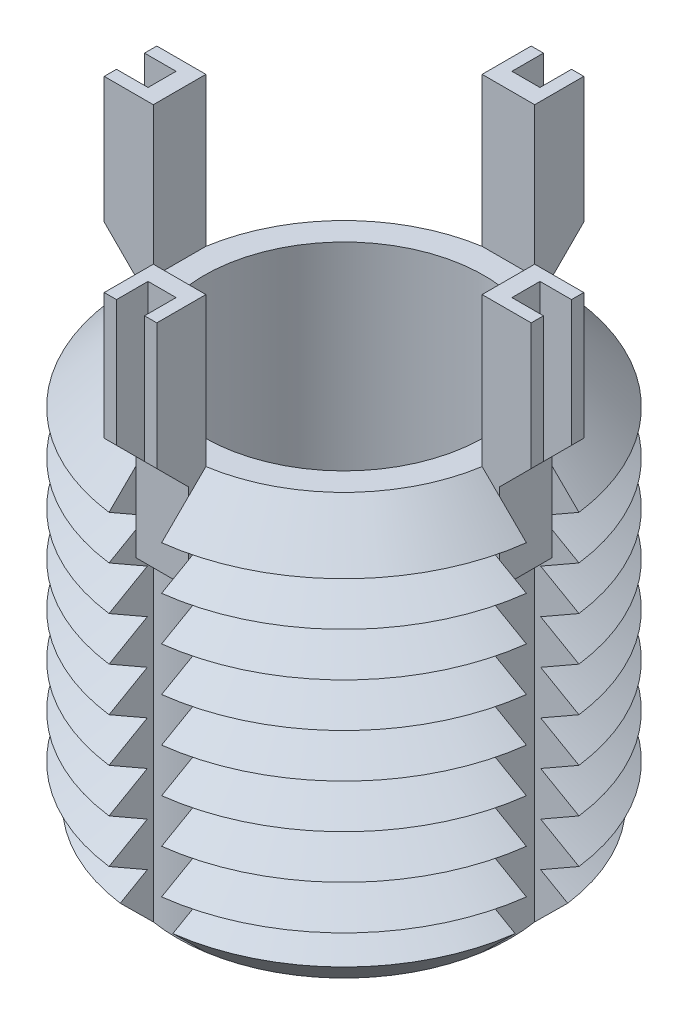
from build123d import *

# Parameters (mm, degrees)
SKETCH1_R               = 6
BOSS_EXTRUDE1_DEPTH     = 12
CHAMFER1_SIZE           = 1.25
LPATTERN1_COUNT         = 8
LPATTERN1_PITCH         = 1.25
CUT_EXTRUDE1_REACH      = 16.697
CIRPATTERN1_COUNT       = 4
BOSS_EXTRUDE3_DEPTH     = 0.75
CIRPATTERN2_COUNT       = 4
CUT_EXTRUDE3_DEPTH      = 19.391542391
CUT_EXTRUDE3_DEPTH_BACK = 19.391542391
SKETCH6_W               = 0.9
SKETCH6_H               = 0.8
SKETCH6_W_2             = 0.8
SKETCH6_H_2             = 0.9
SKETCH7_R               = 4
CUT_EXTRUDE4_DEPTH      = 12


with BuildPart() as part:
    # Sketch1 → Boss-Extrude1 (new body)
    with BuildSketch(Plane(origin=(0, 0, 0), x_dir=(1, 0, 0), z_dir=(0, 1, 0))):
        with Locations(Location((0, 0, 0), (0, 0, 270))):
            Circle(SKETCH1_R)
    extrude(amount=-BOSS_EXTRUDE1_DEPTH)

    # Chamfer1
    chamfer1_edges = [part.edges().sort_by_distance(p)[0] for p in [
        (0, 0, -6),
        (0, -12, -6),
    ]]
    chamfer(chamfer1_edges, length=CHAMFER1_SIZE)

    # Sketch3 → Cut-Revolve1 (revolve, cut)
    with BuildSketch(Plane(origin=(0, 0, 0), x_dir=(0, 0, -1), z_dir=(1, 0, 0))):
        Polygon((-6, -1.25), (-4.917468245, -1.875), (-6, -2.5), align=None)
    cut_revolve1 = revolve(axis=Axis((0, 0.885892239, 0), (0, -1, 0)), mode=Mode.SUBTRACT)

    # LPattern1: Cut-Revolve1 ×8
    with Locations(*[(0, -i * LPATTERN1_PITCH, 0) for i in range(1, LPATTERN1_COUNT)]):
        add(cut_revolve1, mode=Mode.SUBTRACT)

    # Cut-Extrude1: up to this cone (the profile starts inside it)
    cut_extrude1_end = Plane(origin=(0, 0, 0), z_dir=(0, 1, 0)).offset(-16.749999) * Cone(1e-06, 50.697, 50.696999, align=(Align.CENTER, Align.CENTER, Align.MIN), mode=Mode.PRIVATE)
    # Sketch4 → Cut-Extrude1 (cut, up to the surface)
    with BuildSketch(Plane(origin=(0, 0, 0), x_dir=(1, 0, 0), z_dir=(0, 1, 0)), mode=Mode.PRIVATE) as cut_extrude1_sk1:
        with BuildLine():
            Line((-4.69041576, 0.75), (-5.95294045, 0.75))
            ThreePointArc((-5.95294045, 0.75), (-6, 0), (-5.95294045, -0.75))
            Line((-5.95294045, -0.75), (-4.69041576, -0.75))
            ThreePointArc((-4.69041576, -0.75), (-4.75, 0), (-4.69041576, 0.75))
        make_face()
    cut_extrude1_tool1 = extrude(cut_extrude1_sk1.sketch, amount=-CUT_EXTRUDE1_REACH, mode=Mode.PRIVATE) & cut_extrude1_end
    cut_extrude1 = cut_extrude1_tool1.solids().sort_by_distance((-5.357216, 0, 0))[0]
    add(cut_extrude1, mode=Mode.SUBTRACT)

    # CirPattern1: Cut-Extrude1 ×4 about axis
    cirpattern1_axis = Axis((0, 0, 0), (0, 1, 0))
    for i in range(1, CIRPATTERN1_COUNT):
        add(cut_extrude1.rotate(cirpattern1_axis, i * 360 / CIRPATTERN1_COUNT), mode=Mode.SUBTRACT)

    # Sketch5 → Boss-Extrude3 (add, symmetric)
    with BuildSketch(Plane(origin=(0, 0, 0), x_dir=(0, 0, -1), z_dir=(1, 0, 0))):
        Polygon((-4.69041576, 4.25), (-4.69041576, -2.75), (-5.19041576, -2.75), (-5.19041576, -0.25), (-6.09041576, 0.65), (-6.09041576, 4.25), align=None)
    boss_extrude3 = extrude(amount=BOSS_EXTRUDE3_DEPTH, both=True)

    # CirPattern2: Boss-Extrude3 ×4 about axis
    cirpattern2_axis = Axis((0, 0, 0), (0, 1, 0))
    for i in range(1, CIRPATTERN2_COUNT):
        add(boss_extrude3.rotate(cirpattern2_axis, i * 360 / CIRPATTERN2_COUNT))

    # Sketch6 → Cut-Extrude3 (cut, two sides: drawn at the far end of the back side and taken through both)
    with BuildSketch(Plane(origin=(0, 4.25, 0), x_dir=(1, 0, 0), z_dir=(0, 1, 0)).offset(-CUT_EXTRUDE3_DEPTH_BACK)):
        with Locations((-5.64041576, 0)):
            Rectangle(SKETCH6_W, SKETCH6_H)
        with Locations((0, 5.64041576)):
            Rectangle(SKETCH6_W_2, SKETCH6_H_2)
        with Locations((5.64041576, 0)):
            Rectangle(SKETCH6_W, SKETCH6_H)
        with Locations((0, -5.64041576)):
            Rectangle(SKETCH6_W_2, SKETCH6_H_2)
    extrude(amount=CUT_EXTRUDE3_DEPTH + CUT_EXTRUDE3_DEPTH_BACK, mode=Mode.SUBTRACT)

    # Sketch7 → Cut-Extrude4 (cut)
    with BuildSketch(Plane(origin=(0, 0, 0), x_dir=(1, 0, 0), z_dir=(0, 1, 0))):
        with Locations(Location((0, 0, 0), (0, 0, 270))):
            Circle(SKETCH7_R)
    extrude(amount=-CUT_EXTRUDE4_DEPTH, mode=Mode.SUBTRACT)


solid = part.part
